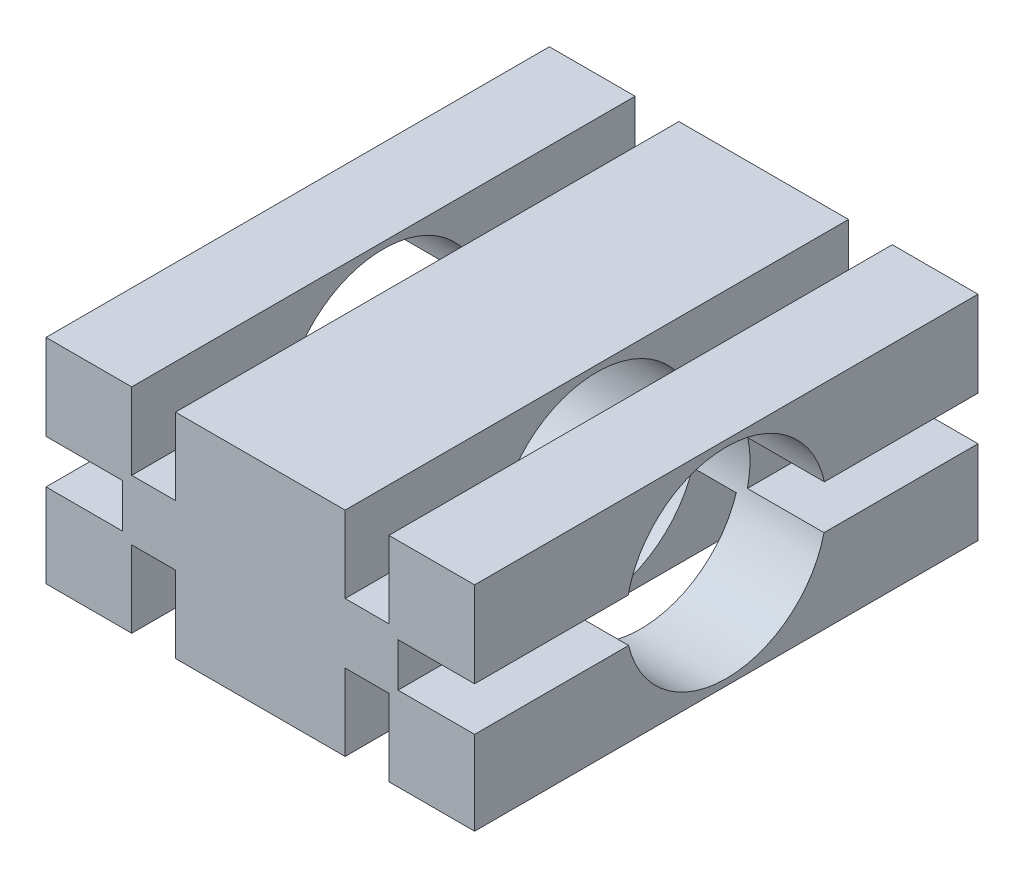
ISO-10303-21;
HEADER;
FILE_DESCRIPTION(('STEP AP214'),'2;1');
FILE_NAME('part.step','',(''),(''),'','','');
FILE_SCHEMA(('AUTOMOTIVE_DESIGN { 1 0 10303 214 1 1 1 1 }'));
ENDSEC;
DATA;
#1=APPLICATION_CONTEXT('core data for automotive mechanical design processes');
#2=APPLICATION_PROTOCOL_DEFINITION('international standard','automotive_design',2000,#1);
#3=PRODUCT_CONTEXT('',#1,'mechanical');
#4=PRODUCT('Part','Part','',(#3));
#5=PRODUCT_RELATED_PRODUCT_CATEGORY('part','',(#4));
#6=PRODUCT_DEFINITION_FORMATION('','',#4);
#7=PRODUCT_DEFINITION_CONTEXT('part definition',#1,'design');
#8=PRODUCT_DEFINITION('design','',#6,#7);
#9=PRODUCT_DEFINITION_SHAPE('','',#8);
#10=(LENGTH_UNIT() NAMED_UNIT(*) SI_UNIT(.MILLI.,.METRE.));
#11=(NAMED_UNIT(*) PLANE_ANGLE_UNIT() SI_UNIT($,.RADIAN.));
#12=(NAMED_UNIT(*) SI_UNIT($,.STERADIAN.) SOLID_ANGLE_UNIT());
#13=UNCERTAINTY_MEASURE_WITH_UNIT(LENGTH_MEASURE(1.E-05),#10,'distance_accuracy_value','');
#14=(GEOMETRIC_REPRESENTATION_CONTEXT(3) GLOBAL_UNCERTAINTY_ASSIGNED_CONTEXT((#13)) GLOBAL_UNIT_ASSIGNED_CONTEXT((#10,
#11,#12)) REPRESENTATION_CONTEXT('',''));
#15=CARTESIAN_POINT('',(0.,0.,0.));
#16=DIRECTION('',(0.,0.,1.));
#17=DIRECTION('',(1.,0.,0.));
#18=AXIS2_PLACEMENT_3D('',#15,#16,#17);
#19=CARTESIAN_POINT('',(11.938,10.668,70.104));
#20=DIRECTION('',(0.,1.,0.));
#21=DIRECTION('',(0.,0.,1.));
#22=AXIS2_PLACEMENT_3D('',#19,#20,#21);
#23=PLANE('',#22);
#24=DIRECTION('',(0.,0.,-1.));
#25=VECTOR('',#24,1.);
#26=CARTESIAN_POINT('',(18.034,10.668,70.104));
#27=LINE('',#26,#25);
#28=CARTESIAN_POINT('',(18.034,10.668,21.7254693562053));
#29=VERTEX_POINT('',#28);
#30=CARTESIAN_POINT('',(18.034,10.668,0.));
#31=VERTEX_POINT('',#30);
#32=EDGE_CURVE('E456',#29,#31,#27,.T.);
#33=ORIENTED_EDGE('',*,*,#32,.F.);
#34=DIRECTION('',(-1.,0.,0.));
#35=VECTOR('',#34,1.);
#36=CARTESIAN_POINT('',(59.69,10.668,21.7254693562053));
#37=LINE('',#36,#35);
#38=CARTESIAN_POINT('',(11.938,10.6680000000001,21.7254693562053));
#39=VERTEX_POINT('',#38);
#40=EDGE_CURVE('E55',#29,#39,#37,.T.);
#41=ORIENTED_EDGE('',*,*,#40,.T.);
#42=DIRECTION('',(0.,0.,-1.));
#43=VECTOR('',#42,1.);
#44=CARTESIAN_POINT('',(11.938,10.668,70.104));
#45=LINE('',#44,#43);
#46=CARTESIAN_POINT('',(11.938,10.668,0.));
#47=VERTEX_POINT('',#46);
#48=EDGE_CURVE('E461',#39,#47,#45,.T.);
#49=ORIENTED_EDGE('',*,*,#48,.T.);
#50=DIRECTION('',(1.,0.,0.));
#51=VECTOR('',#50,1.);
#52=CARTESIAN_POINT('',(11.938,10.668,0.));
#53=LINE('',#52,#51);
#54=EDGE_CURVE('E593',#47,#31,#53,.T.);
#55=ORIENTED_EDGE('',*,*,#54,.T.);
#56=EDGE_LOOP('',(#33,#41,#49,#55));
#57=FACE_BOUND('',#56,.T.);
#58=ADVANCED_FACE('F39',(#57),#23,.F.);
#59=CARTESIAN_POINT('',(47.752,10.668,70.104));
#60=DIRECTION('',(0.,1.,0.));
#61=DIRECTION('',(0.,0.,1.));
#62=AXIS2_PLACEMENT_3D('',#59,#60,#61);
#63=PLANE('',#62);
#64=DIRECTION('',(0.,0.,-1.));
#65=VECTOR('',#64,1.);
#66=CARTESIAN_POINT('',(47.752,10.668,70.104));
#67=LINE('',#66,#65);
#68=CARTESIAN_POINT('',(47.752,10.668,21.7254693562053));
#69=VERTEX_POINT('',#68);
#70=CARTESIAN_POINT('',(47.752,10.668,0.));
#71=VERTEX_POINT('',#70);
#72=EDGE_CURVE('E438',#69,#71,#67,.T.);
#73=ORIENTED_EDGE('',*,*,#72,.F.);
#74=DIRECTION('',(-1.,0.,0.));
#75=VECTOR('',#74,1.);
#76=CARTESIAN_POINT('',(59.69,10.668,21.7254693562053));
#77=LINE('',#76,#75);
#78=CARTESIAN_POINT('',(41.656,10.668,21.7254693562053));
#79=VERTEX_POINT('',#78);
#80=EDGE_CURVE('E63',#69,#79,#77,.T.);
#81=ORIENTED_EDGE('',*,*,#80,.T.);
#82=DIRECTION('',(0.,0.,-1.));
#83=VECTOR('',#82,1.);
#84=CARTESIAN_POINT('',(41.656,10.668,70.104));
#85=LINE('',#84,#83);
#86=CARTESIAN_POINT('',(41.656,10.668,0.));
#87=VERTEX_POINT('',#86);
#88=EDGE_CURVE('E443',#79,#87,#85,.T.);
#89=ORIENTED_EDGE('',*,*,#88,.T.);
#90=DIRECTION('',(1.,0.,0.));
#91=VECTOR('',#90,1.);
#92=CARTESIAN_POINT('',(47.752,10.668,0.));
#93=LINE('',#92,#91);
#94=EDGE_CURVE('E607',#87,#71,#93,.T.);
#95=ORIENTED_EDGE('',*,*,#94,.T.);
#96=EDGE_LOOP('',(#73,#81,#89,#95));
#97=FACE_BOUND('',#96,.T.);
#98=ADVANCED_FACE('F786',(#97),#63,.F.);
#99=CARTESIAN_POINT('',(59.69,11.684,70.104));
#100=DIRECTION('',(0.,-1.,0.));
#101=DIRECTION('',(0.,0.,-1.));
#102=AXIS2_PLACEMENT_3D('',#99,#100,#101);
#103=PLANE('',#102);
#104=DIRECTION('',(0.,0.,-1.));
#105=VECTOR('',#104,1.);
#106=CARTESIAN_POINT('',(59.69,11.684,70.104));
#107=LINE('',#106,#105);
#108=CARTESIAN_POINT('',(59.69,11.684,70.104));
#109=VERTEX_POINT('',#108);
#110=CARTESIAN_POINT('',(59.69,11.684,48.6564211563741));
#111=VERTEX_POINT('',#110);
#112=EDGE_CURVE('E426',#109,#111,#107,.T.);
#113=ORIENTED_EDGE('',*,*,#112,.T.);
#114=DIRECTION('',(-1.,0.,0.));
#115=VECTOR('',#114,1.);
#116=CARTESIAN_POINT('',(59.69,11.684,48.6564211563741));
#117=LINE('',#116,#115);
#118=CARTESIAN_POINT('',(49.022,11.684,48.6564211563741));
#119=VERTEX_POINT('',#118);
#120=EDGE_CURVE('E849',#111,#119,#117,.T.);
#121=ORIENTED_EDGE('',*,*,#120,.T.);
#122=DIRECTION('',(0.,0.,-1.));
#123=VECTOR('',#122,1.);
#124=CARTESIAN_POINT('',(49.022,11.684,70.104));
#125=LINE('',#124,#123);
#126=CARTESIAN_POINT('',(49.022,11.684,70.104));
#127=VERTEX_POINT('',#126);
#128=EDGE_CURVE('E421',#127,#119,#125,.T.);
#129=ORIENTED_EDGE('',*,*,#128,.F.);
#130=DIRECTION('',(-1.,0.,0.));
#131=VECTOR('',#130,1.);
#132=CARTESIAN_POINT('',(59.69,11.684,70.104));
#133=LINE('',#132,#131);
#134=EDGE_CURVE('E534',#109,#127,#133,.T.);
#135=ORIENTED_EDGE('',*,*,#134,.F.);
#136=EDGE_LOOP('',(#113,#121,#129,#135));
#137=FACE_BOUND('',#136,.T.);
#138=ADVANCED_FACE('F930',(#137),#103,.F.);
#139=CARTESIAN_POINT('',(49.022,17.78,70.104));
#140=DIRECTION('',(-1.,0.,0.));
#141=DIRECTION('',(0.,0.,1.));
#142=AXIS2_PLACEMENT_3D('',#139,#140,#141);
#143=PLANE('',#142);
#144=DIRECTION('',(0.,0.,-1.));
#145=VECTOR('',#144,1.);
#146=CARTESIAN_POINT('',(49.022,17.78,70.104));
#147=LINE('',#146,#145);
#148=CARTESIAN_POINT('',(49.022,17.78,21.3907899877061));
#149=VERTEX_POINT('',#148);
#150=CARTESIAN_POINT('',(49.022,17.78,0.));
#151=VERTEX_POINT('',#150);
#152=EDGE_CURVE('E415',#149,#151,#147,.T.);
#153=ORIENTED_EDGE('',*,*,#152,.F.);
#154=CARTESIAN_POINT('',(49.022,14.859,35.052));
#155=DIRECTION('',(-1.,0.,0.));
#156=DIRECTION('',(0.,0.,1.));
#157=AXIS2_PLACEMENT_3D('',#154,#155,#156);
#158=CIRCLE('',#157,13.97);
#159=CARTESIAN_POINT('',(49.022,11.684,21.4475788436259));
#160=VERTEX_POINT('',#159);
#161=EDGE_CURVE('E759',#149,#160,#158,.T.);
#162=ORIENTED_EDGE('',*,*,#161,.T.);
#163=CARTESIAN_POINT('',(49.022,11.684,0.));
#164=VERTEX_POINT('',#163);
#165=EDGE_CURVE('E420',#160,#164,#125,.T.);
#166=ORIENTED_EDGE('',*,*,#165,.T.);
#167=DIRECTION('',(0.,1.,0.));
#168=VECTOR('',#167,1.);
#169=CARTESIAN_POINT('',(49.022,17.78,0.));
#170=LINE('',#169,#168);
#171=EDGE_CURVE('E625',#164,#151,#170,.T.);
#172=ORIENTED_EDGE('',*,*,#171,.T.);
#173=EDGE_LOOP('',(#153,#162,#166,#172));
#174=FACE_BOUND('',#173,.T.);
#175=ADVANCED_FACE('F756',(#174),#143,.F.);
#176=CARTESIAN_POINT('',(59.69,17.78,70.104));
#177=DIRECTION('',(0.,1.,0.));
#178=DIRECTION('',(0.,0.,1.));
#179=AXIS2_PLACEMENT_3D('',#176,#177,#178);
#180=PLANE('',#179);
#181=DIRECTION('',(0.,0.,-1.));
#182=VECTOR('',#181,1.);
#183=CARTESIAN_POINT('',(59.69,17.78,70.104));
#184=LINE('',#183,#182);
#185=CARTESIAN_POINT('',(59.69,17.78,21.3907899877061));
#186=VERTEX_POINT('',#185);
#187=CARTESIAN_POINT('',(59.69,17.78,0.));
#188=VERTEX_POINT('',#187);
#189=EDGE_CURVE('E410',#186,#188,#184,.T.);
#190=ORIENTED_EDGE('',*,*,#189,.F.);
#191=DIRECTION('',(-1.,0.,0.));
#192=VECTOR('',#191,1.);
#193=CARTESIAN_POINT('',(59.69,17.78,21.3907899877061));
#194=LINE('',#193,#192);
#195=EDGE_CURVE('E846',#186,#149,#194,.T.);
#196=ORIENTED_EDGE('',*,*,#195,.T.);
#197=ORIENTED_EDGE('',*,*,#152,.T.);
#198=DIRECTION('',(1.,0.,0.));
#199=VECTOR('',#198,1.);
#200=CARTESIAN_POINT('',(59.69,17.78,0.));
#201=LINE('',#200,#199);
#202=EDGE_CURVE('E629',#151,#188,#201,.T.);
#203=ORIENTED_EDGE('',*,*,#202,.T.);
#204=EDGE_LOOP('',(#190,#196,#197,#203));
#205=FACE_BOUND('',#204,.T.);
#206=ADVANCED_FACE('F750',(#205),#180,.F.);
#207=CARTESIAN_POINT('',(47.752,19.05,70.104));
#208=DIRECTION('',(0.,-1.,0.));
#209=DIRECTION('',(0.,0.,-1.));
#210=AXIS2_PLACEMENT_3D('',#207,#208,#209);
#211=PLANE('',#210);
#212=DIRECTION('',(0.,0.,-1.));
#213=VECTOR('',#212,1.);
#214=CARTESIAN_POINT('',(47.752,19.05,70.104));
#215=LINE('',#214,#213);
#216=CARTESIAN_POINT('',(47.752,19.05,70.104));
#217=VERTEX_POINT('',#216);
#218=CARTESIAN_POINT('',(47.752,19.05,48.3785306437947));
#219=VERTEX_POINT('',#218);
#220=EDGE_CURVE('E398',#217,#219,#215,.T.);
#221=ORIENTED_EDGE('',*,*,#220,.T.);
#222=DIRECTION('',(-1.,0.,0.));
#223=VECTOR('',#222,1.);
#224=CARTESIAN_POINT('',(59.69,19.05,48.3785306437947));
#225=LINE('',#224,#223);
#226=CARTESIAN_POINT('',(41.656,19.05,48.3785306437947));
#227=VERTEX_POINT('',#226);
#228=EDGE_CURVE('E864',#219,#227,#225,.T.);
#229=ORIENTED_EDGE('',*,*,#228,.T.);
#230=DIRECTION('',(0.,0.,-1.));
#231=VECTOR('',#230,1.);
#232=CARTESIAN_POINT('',(41.656,19.05,70.104));
#233=LINE('',#232,#231);
#234=CARTESIAN_POINT('',(41.656,19.05,70.104));
#235=VERTEX_POINT('',#234);
#236=EDGE_CURVE('E393',#235,#227,#233,.T.);
#237=ORIENTED_EDGE('',*,*,#236,.F.);
#238=DIRECTION('',(-1.,0.,0.));
#239=VECTOR('',#238,1.);
#240=CARTESIAN_POINT('',(47.752,19.05,70.104));
#241=LINE('',#240,#239);
#242=EDGE_CURVE('E552',#217,#235,#241,.T.);
#243=ORIENTED_EDGE('',*,*,#242,.F.);
#244=EDGE_LOOP('',(#221,#229,#237,#243));
#245=FACE_BOUND('',#244,.T.);
#246=ADVANCED_FACE('F972',(#245),#211,.F.);
#247=CARTESIAN_POINT('',(11.938,19.05,70.104));
#248=DIRECTION('',(0.,-1.,0.));
#249=DIRECTION('',(0.,0.,-1.));
#250=AXIS2_PLACEMENT_3D('',#247,#248,#249);
#251=PLANE('',#250);
#252=DIRECTION('',(0.,0.,-1.));
#253=VECTOR('',#252,1.);
#254=CARTESIAN_POINT('',(18.034,19.05,70.104));
#255=LINE('',#254,#253);
#256=CARTESIAN_POINT('',(18.034,19.05,70.104));
#257=VERTEX_POINT('',#256);
#258=CARTESIAN_POINT('',(18.034,19.05,48.3785306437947));
#259=VERTEX_POINT('',#258);
#260=EDGE_CURVE('E380',#257,#259,#255,.T.);
#261=ORIENTED_EDGE('',*,*,#260,.T.);
#262=DIRECTION('',(-1.,0.,0.));
#263=VECTOR('',#262,1.);
#264=CARTESIAN_POINT('',(59.69,19.05,48.3785306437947));
#265=LINE('',#264,#263);
#266=CARTESIAN_POINT('',(11.938,19.05,48.3785306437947));
#267=VERTEX_POINT('',#266);
#268=EDGE_CURVE('E875',#259,#267,#265,.T.);
#269=ORIENTED_EDGE('',*,*,#268,.T.);
#270=DIRECTION('',(0.,0.,-1.));
#271=VECTOR('',#270,1.);
#272=CARTESIAN_POINT('',(11.938,19.05,70.104));
#273=LINE('',#272,#271);
#274=CARTESIAN_POINT('',(11.938,19.05,70.104));
#275=VERTEX_POINT('',#274);
#276=EDGE_CURVE('E375',#275,#267,#273,.T.);
#277=ORIENTED_EDGE('',*,*,#276,.F.);
#278=DIRECTION('',(-1.,0.,0.));
#279=VECTOR('',#278,1.);
#280=CARTESIAN_POINT('',(11.938,19.05,70.104));
#281=LINE('',#280,#279);
#282=EDGE_CURVE('E564',#257,#275,#281,.T.);
#283=ORIENTED_EDGE('',*,*,#282,.F.);
#284=EDGE_LOOP('',(#261,#269,#277,#283));
#285=FACE_BOUND('',#284,.T.);
#286=ADVANCED_FACE('F907',(#285),#251,.F.);
#287=CARTESIAN_POINT('',(0.,17.78,70.104));
#288=DIRECTION('',(0.,1.,0.));
#289=DIRECTION('',(0.,0.,1.));
#290=AXIS2_PLACEMENT_3D('',#287,#288,#289);
#291=PLANE('',#290);
#292=DIRECTION('',(0.,0.,-1.));
#293=VECTOR('',#292,1.);
#294=CARTESIAN_POINT('',(10.668,17.78,70.104));
#295=LINE('',#294,#293);
#296=CARTESIAN_POINT('',(10.668,17.78,21.390789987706));
#297=VERTEX_POINT('',#296);
#298=CARTESIAN_POINT('',(10.668,17.78,0.));
#299=VERTEX_POINT('',#298);
#300=EDGE_CURVE('E356',#297,#299,#295,.T.);
#301=ORIENTED_EDGE('',*,*,#300,.F.);
#302=DIRECTION('',(-1.,0.,0.));
#303=VECTOR('',#302,1.);
#304=CARTESIAN_POINT('',(59.69,17.78,21.3907899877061));
#305=LINE('',#304,#303);
#306=CARTESIAN_POINT('',(0.,17.78,21.390789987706));
#307=VERTEX_POINT('',#306);
#308=EDGE_CURVE('E889',#297,#307,#305,.T.);
#309=ORIENTED_EDGE('',*,*,#308,.T.);
#310=DIRECTION('',(0.,0.,-1.));
#311=VECTOR('',#310,1.);
#312=CARTESIAN_POINT('',(0.,17.78,70.104));
#313=LINE('',#312,#311);
#314=CARTESIAN_POINT('',(0.,17.78,0.));
#315=VERTEX_POINT('',#314);
#316=EDGE_CURVE('E361',#307,#315,#313,.T.);
#317=ORIENTED_EDGE('',*,*,#316,.T.);
#318=DIRECTION('',(1.,0.,0.));
#319=VECTOR('',#318,1.);
#320=CARTESIAN_POINT('',(0.,17.78,0.));
#321=LINE('',#320,#319);
#322=EDGE_CURVE('E491',#315,#299,#321,.T.);
#323=ORIENTED_EDGE('',*,*,#322,.T.);
#324=EDGE_LOOP('',(#301,#309,#317,#323));
#325=FACE_BOUND('',#324,.T.);
#326=ADVANCED_FACE('F673',(#325),#291,.F.);
#327=CARTESIAN_POINT('',(10.668,17.78,70.104));
#328=DIRECTION('',(1.,0.,0.));
#329=DIRECTION('',(0.,0.,-1.));
#330=AXIS2_PLACEMENT_3D('',#327,#328,#329);
#331=PLANE('',#330);
#332=CARTESIAN_POINT('',(10.668,17.78,70.104));
#333=VERTEX_POINT('',#332);
#334=CARTESIAN_POINT('',(10.668,17.78,48.7132100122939));
#335=VERTEX_POINT('',#334);
#336=EDGE_CURVE('E357',#333,#335,#295,.T.);
#337=ORIENTED_EDGE('',*,*,#336,.T.);
#338=CARTESIAN_POINT('',(10.668,14.8590000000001,35.052));
#339=DIRECTION('',(1.,0.,0.));
#340=DIRECTION('',(0.,0.,-1.));
#341=AXIS2_PLACEMENT_3D('',#338,#339,#340);
#342=CIRCLE('',#341,13.97);
#343=CARTESIAN_POINT('',(10.668,11.6840000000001,48.6564211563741));
#344=VERTEX_POINT('',#343);
#345=EDGE_CURVE('E888',#335,#344,#342,.T.);
#346=ORIENTED_EDGE('',*,*,#345,.T.);
#347=DIRECTION('',(0.,0.,-1.));
#348=VECTOR('',#347,1.);
#349=CARTESIAN_POINT('',(10.668,11.684,70.104));
#350=LINE('',#349,#348);
#351=CARTESIAN_POINT('',(10.668,11.684,70.104));
#352=VERTEX_POINT('',#351);
#353=EDGE_CURVE('E339',#352,#344,#350,.T.);
#354=ORIENTED_EDGE('',*,*,#353,.F.);
#355=DIRECTION('',(0.,-1.,0.));
#356=VECTOR('',#355,1.);
#357=CARTESIAN_POINT('',(10.668,17.78,70.104));
#358=LINE('',#357,#356);
#359=EDGE_CURVE('E579',#333,#352,#358,.T.);
#360=ORIENTED_EDGE('',*,*,#359,.F.);
#361=EDGE_LOOP('',(#337,#346,#354,#360));
#362=FACE_BOUND('',#361,.T.);
#363=ADVANCED_FACE('F915',(#362),#331,.F.);
#364=CARTESIAN_POINT('',(0.,11.684,70.104));
#365=DIRECTION('',(0.,-1.,0.));
#366=DIRECTION('',(0.,0.,-1.));
#367=AXIS2_PLACEMENT_3D('',#364,#365,#366);
#368=PLANE('',#367);
#369=ORIENTED_EDGE('',*,*,#353,.T.);
#370=DIRECTION('',(-1.,0.,0.));
#371=VECTOR('',#370,1.);
#372=CARTESIAN_POINT('',(59.69,11.684,48.6564211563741));
#373=LINE('',#372,#371);
#374=CARTESIAN_POINT('',(0.,11.684,48.6564211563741));
#375=VERTEX_POINT('',#374);
#376=EDGE_CURVE('E11',#344,#375,#373,.T.);
#377=ORIENTED_EDGE('',*,*,#376,.T.);
#378=DIRECTION('',(0.,0.,-1.));
#379=VECTOR('',#378,1.);
#380=CARTESIAN_POINT('',(0.,11.684,70.104));
#381=LINE('',#380,#379);
#382=CARTESIAN_POINT('',(0.,11.684,70.104));
#383=VERTEX_POINT('',#382);
#384=EDGE_CURVE('E336',#383,#375,#381,.T.);
#385=ORIENTED_EDGE('',*,*,#384,.F.);
#386=DIRECTION('',(-1.,0.,0.));
#387=VECTOR('',#386,1.);
#388=CARTESIAN_POINT('',(0.,11.684,70.104));
#389=LINE('',#388,#387);
#390=EDGE_CURVE('E350',#352,#383,#389,.T.);
#391=ORIENTED_EDGE('',*,*,#390,.F.);
#392=EDGE_LOOP('',(#369,#377,#385,#391));
#393=FACE_BOUND('',#392,.T.);
#394=ADVANCED_FACE('F334',(#393),#368,.F.);
#395=CARTESIAN_POINT('',(0.,0.,70.104));
#396=DIRECTION('',(1.,0.,0.));
#397=DIRECTION('',(0.,1.,0.));
#398=AXIS2_PLACEMENT_3D('',#395,#396,#397);
#399=PLANE('',#398);
#400=ORIENTED_EDGE('',*,*,#384,.T.);
#401=CARTESIAN_POINT('',(0.,14.8590000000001,35.052));
#402=DIRECTION('',(-1.,0.,0.));
#403=DIRECTION('',(0.,-1.,0.));
#404=AXIS2_PLACEMENT_3D('',#401,#402,#403);
#405=CIRCLE('',#404,13.97);
#406=CARTESIAN_POINT('',(0.,11.684,21.4475788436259));
#407=VERTEX_POINT('',#406);
#408=EDGE_CURVE('E320',#407,#375,#405,.T.);
#409=ORIENTED_EDGE('',*,*,#408,.F.);
#410=CARTESIAN_POINT('',(0.,11.684,0.));
#411=VERTEX_POINT('',#410);
#412=EDGE_CURVE('E345',#407,#411,#381,.T.);
#413=ORIENTED_EDGE('',*,*,#412,.T.);
#414=DIRECTION('',(0.,-1.,0.));
#415=VECTOR('',#414,1.);
#416=CARTESIAN_POINT('',(0.,0.,0.));
#417=LINE('',#416,#415);
#418=CARTESIAN_POINT('',(0.,0.,0.));
#419=VERTEX_POINT('',#418);
#420=EDGE_CURVE('E495',#411,#419,#417,.T.);
#421=ORIENTED_EDGE('',*,*,#420,.T.);
#422=DIRECTION('',(0.,0.,-1.));
#423=VECTOR('',#422,1.);
#424=CARTESIAN_POINT('',(0.,0.,70.104));
#425=LINE('',#424,#423);
#426=CARTESIAN_POINT('',(0.,0.,70.104));
#427=VERTEX_POINT('',#426);
#428=EDGE_CURVE('E470',#427,#419,#425,.T.);
#429=ORIENTED_EDGE('',*,*,#428,.F.);
#430=DIRECTION('',(0.,-1.,0.));
#431=VECTOR('',#430,1.);
#432=CARTESIAN_POINT('',(0.,0.,70.104));
#433=LINE('',#432,#431);
#434=EDGE_CURVE('E342',#383,#427,#433,.T.);
#435=ORIENTED_EDGE('',*,*,#434,.F.);
#436=EDGE_LOOP('',(#400,#409,#413,#421,#429,#435));
#437=FACE_BOUND('',#436,.T.);
#438=ADVANCED_FACE('F41',(#437),#399,.F.);
#439=CARTESIAN_POINT('',(0.,0.,70.104));
#440=DIRECTION('',(0.,1.,0.));
#441=DIRECTION('',(0.,0.,1.));
#442=AXIS2_PLACEMENT_3D('',#439,#440,#441);
#443=PLANE('',#442);
#444=DIRECTION('',(1.,0.,0.));
#445=VECTOR('',#444,1.);
#446=CARTESIAN_POINT('',(0.,0.,0.));
#447=LINE('',#446,#445);
#448=CARTESIAN_POINT('',(11.938,0.,0.));
#449=VERTEX_POINT('',#448);
#450=EDGE_CURVE('E586',#419,#449,#447,.T.);
#451=ORIENTED_EDGE('',*,*,#450,.T.);
#452=DIRECTION('',(0.,0.,-1.));
#453=VECTOR('',#452,1.);
#454=CARTESIAN_POINT('',(11.938,0.,70.104));
#455=LINE('',#454,#453);
#456=CARTESIAN_POINT('',(11.938,0.,70.104));
#457=VERTEX_POINT('',#456);
#458=EDGE_CURVE('E466',#457,#449,#455,.T.);
#459=ORIENTED_EDGE('',*,*,#458,.F.);
#460=DIRECTION('',(1.,0.,0.));
#461=VECTOR('',#460,1.);
#462=CARTESIAN_POINT('',(0.,0.,70.104));
#463=LINE('',#462,#461);
#464=EDGE_CURVE('E498',#427,#457,#463,.T.);
#465=ORIENTED_EDGE('',*,*,#464,.F.);
#466=ORIENTED_EDGE('',*,*,#428,.T.);
#467=EDGE_LOOP('',(#451,#459,#465,#466));
#468=FACE_BOUND('',#467,.T.);
#469=ADVANCED_FACE('F817',(#468),#443,.F.);
#470=CARTESIAN_POINT('',(11.938,0.,70.104));
#471=DIRECTION('',(-1.,0.,0.));
#472=DIRECTION('',(0.,0.,1.));
#473=AXIS2_PLACEMENT_3D('',#470,#471,#472);
#474=PLANE('',#473);
#475=ORIENTED_EDGE('',*,*,#48,.F.);
#476=CARTESIAN_POINT('',(11.938,14.8590000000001,35.052));
#477=DIRECTION('',(-1.,0.,0.));
#478=DIRECTION('',(0.,0.,1.));
#479=AXIS2_PLACEMENT_3D('',#476,#477,#478);
#480=CIRCLE('',#479,13.97);
#481=CARTESIAN_POINT('',(11.938,10.6680000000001,48.3785306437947));
#482=VERTEX_POINT('',#481);
#483=EDGE_CURVE('E505',#39,#482,#480,.T.);
#484=ORIENTED_EDGE('',*,*,#483,.T.);
#485=CARTESIAN_POINT('',(11.938,10.668,70.104));
#486=VERTEX_POINT('',#485);
#487=EDGE_CURVE('E462',#486,#482,#45,.T.);
#488=ORIENTED_EDGE('',*,*,#487,.F.);
#489=DIRECTION('',(0.,1.,0.));
#490=VECTOR('',#489,1.);
#491=CARTESIAN_POINT('',(11.938,0.,70.104));
#492=LINE('',#491,#490);
#493=EDGE_CURVE('E502',#457,#486,#492,.T.);
#494=ORIENTED_EDGE('',*,*,#493,.F.);
#495=ORIENTED_EDGE('',*,*,#458,.T.);
#496=DIRECTION('',(0.,1.,0.));
#497=VECTOR('',#496,1.);
#498=CARTESIAN_POINT('',(11.938,0.,0.));
#499=LINE('',#498,#497);
#500=EDGE_CURVE('E589',#449,#47,#499,.T.);
#501=ORIENTED_EDGE('',*,*,#500,.T.);
#502=EDGE_LOOP('',(#475,#484,#488,#494,#495,#501));
#503=FACE_BOUND('',#502,.T.);
#504=ADVANCED_FACE('F812',(#503),#474,.F.);
#505=ORIENTED_EDGE('',*,*,#487,.T.);
#506=DIRECTION('',(-1.,0.,0.));
#507=VECTOR('',#506,1.);
#508=CARTESIAN_POINT('',(59.69,10.668,48.3785306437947));
#509=LINE('',#508,#507);
#510=CARTESIAN_POINT('',(18.034,10.668,48.3785306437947));
#511=VERTEX_POINT('',#510);
#512=EDGE_CURVE('E824',#482,#511,#509,.F.);
#513=ORIENTED_EDGE('',*,*,#512,.T.);
#514=CARTESIAN_POINT('',(18.034,10.668,70.104));
#515=VERTEX_POINT('',#514);
#516=EDGE_CURVE('E457',#515,#511,#27,.T.);
#517=ORIENTED_EDGE('',*,*,#516,.F.);
#518=DIRECTION('',(1.,0.,0.));
#519=VECTOR('',#518,1.);
#520=CARTESIAN_POINT('',(11.938,10.668,70.104));
#521=LINE('',#520,#519);
#522=EDGE_CURVE('E510',#486,#515,#521,.T.);
#523=ORIENTED_EDGE('',*,*,#522,.F.);
#524=EDGE_LOOP('',(#505,#513,#517,#523));
#525=FACE_BOUND('',#524,.T.);
#526=ADVANCED_FACE('F823',(#525),#23,.F.);
#527=CARTESIAN_POINT('',(18.034,0.,70.104));
#528=DIRECTION('',(1.,0.,0.));
#529=DIRECTION('',(0.,0.,-1.));
#530=AXIS2_PLACEMENT_3D('',#527,#528,#529);
#531=PLANE('',#530);
#532=ORIENTED_EDGE('',*,*,#516,.T.);
#533=CARTESIAN_POINT('',(18.034,14.859,35.052));
#534=DIRECTION('',(1.,0.,0.));
#535=DIRECTION('',(0.,0.,-1.));
#536=AXIS2_PLACEMENT_3D('',#533,#534,#535);
#537=CIRCLE('',#536,13.97);
#538=EDGE_CURVE('E825',#511,#29,#537,.T.);
#539=ORIENTED_EDGE('',*,*,#538,.T.);
#540=ORIENTED_EDGE('',*,*,#32,.T.);
#541=DIRECTION('',(0.,-1.,0.));
#542=VECTOR('',#541,1.);
#543=CARTESIAN_POINT('',(18.034,0.,0.));
#544=LINE('',#543,#542);
#545=CARTESIAN_POINT('',(18.034,0.,0.));
#546=VERTEX_POINT('',#545);
#547=EDGE_CURVE('E597',#31,#546,#544,.T.);
#548=ORIENTED_EDGE('',*,*,#547,.T.);
#549=DIRECTION('',(0.,0.,-1.));
#550=VECTOR('',#549,1.);
#551=CARTESIAN_POINT('',(18.034,0.,70.104));
#552=LINE('',#551,#550);
#553=CARTESIAN_POINT('',(18.034,0.,70.104));
#554=VERTEX_POINT('',#553);
#555=EDGE_CURVE('E452',#554,#546,#552,.T.);
#556=ORIENTED_EDGE('',*,*,#555,.F.);
#557=DIRECTION('',(0.,-1.,0.));
#558=VECTOR('',#557,1.);
#559=CARTESIAN_POINT('',(18.034,0.,70.104));
#560=LINE('',#559,#558);
#561=EDGE_CURVE('E513',#515,#554,#560,.T.);
#562=ORIENTED_EDGE('',*,*,#561,.F.);
#563=EDGE_LOOP('',(#532,#539,#540,#548,#556,#562));
#564=FACE_BOUND('',#563,.T.);
#565=ADVANCED_FACE('F803',(#564),#531,.F.);
#566=CARTESIAN_POINT('',(18.034,0.,70.104));
#567=DIRECTION('',(0.,1.,0.));
#568=DIRECTION('',(0.,0.,1.));
#569=AXIS2_PLACEMENT_3D('',#566,#567,#568);
#570=PLANE('',#569);
#571=DIRECTION('',(1.,0.,0.));
#572=VECTOR('',#571,1.);
#573=CARTESIAN_POINT('',(18.034,0.,0.));
#574=LINE('',#573,#572);
#575=CARTESIAN_POINT('',(41.656,0.,0.));
#576=VERTEX_POINT('',#575);
#577=EDGE_CURVE('E600',#546,#576,#574,.T.);
#578=ORIENTED_EDGE('',*,*,#577,.T.);
#579=DIRECTION('',(0.,0.,-1.));
#580=VECTOR('',#579,1.);
#581=CARTESIAN_POINT('',(41.656,0.,70.104));
#582=LINE('',#581,#580);
#583=CARTESIAN_POINT('',(41.656,0.,70.104));
#584=VERTEX_POINT('',#583);
#585=EDGE_CURVE('E448',#584,#576,#582,.T.);
#586=ORIENTED_EDGE('',*,*,#585,.F.);
#587=DIRECTION('',(1.,0.,0.));
#588=VECTOR('',#587,1.);
#589=CARTESIAN_POINT('',(18.034,0.,70.104));
#590=LINE('',#589,#588);
#591=EDGE_CURVE('E516',#554,#584,#590,.T.);
#592=ORIENTED_EDGE('',*,*,#591,.F.);
#593=ORIENTED_EDGE('',*,*,#555,.T.);
#594=EDGE_LOOP('',(#578,#586,#592,#593));
#595=FACE_BOUND('',#594,.T.);
#596=ADVANCED_FACE('F799',(#595),#570,.F.);
#597=CARTESIAN_POINT('',(41.656,0.,70.104));
#598=DIRECTION('',(-1.,0.,0.));
#599=DIRECTION('',(0.,0.,1.));
#600=AXIS2_PLACEMENT_3D('',#597,#598,#599);
#601=PLANE('',#600);
#602=ORIENTED_EDGE('',*,*,#88,.F.);
#603=CARTESIAN_POINT('',(41.656,14.859,35.052));
#604=DIRECTION('',(-1.,0.,0.));
#605=DIRECTION('',(0.,0.,1.));
#606=AXIS2_PLACEMENT_3D('',#603,#604,#605);
#607=CIRCLE('',#606,13.97);
#608=CARTESIAN_POINT('',(41.656,10.668,48.3785306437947));
#609=VERTEX_POINT('',#608);
#610=EDGE_CURVE('E827',#79,#609,#607,.T.);
#611=ORIENTED_EDGE('',*,*,#610,.T.);
#612=CARTESIAN_POINT('',(41.656,10.668,70.104));
#613=VERTEX_POINT('',#612);
#614=EDGE_CURVE('E444',#613,#609,#85,.T.);
#615=ORIENTED_EDGE('',*,*,#614,.F.);
#616=DIRECTION('',(0.,1.,0.));
#617=VECTOR('',#616,1.);
#618=CARTESIAN_POINT('',(41.656,0.,70.104));
#619=LINE('',#618,#617);
#620=EDGE_CURVE('E519',#584,#613,#619,.T.);
#621=ORIENTED_EDGE('',*,*,#620,.F.);
#622=ORIENTED_EDGE('',*,*,#585,.T.);
#623=DIRECTION('',(0.,1.,0.));
#624=VECTOR('',#623,1.);
#625=CARTESIAN_POINT('',(41.656,0.,0.));
#626=LINE('',#625,#624);
#627=EDGE_CURVE('E603',#576,#87,#626,.T.);
#628=ORIENTED_EDGE('',*,*,#627,.T.);
#629=EDGE_LOOP('',(#602,#611,#615,#621,#622,#628));
#630=FACE_BOUND('',#629,.T.);
#631=ADVANCED_FACE('F792',(#630),#601,.F.);
#632=ORIENTED_EDGE('',*,*,#614,.T.);
#633=DIRECTION('',(-1.,0.,0.));
#634=VECTOR('',#633,1.);
#635=CARTESIAN_POINT('',(59.69,10.668,48.3785306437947));
#636=LINE('',#635,#634);
#637=CARTESIAN_POINT('',(47.752,10.668,48.3785306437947));
#638=VERTEX_POINT('',#637);
#639=EDGE_CURVE('E838',#609,#638,#636,.F.);
#640=ORIENTED_EDGE('',*,*,#639,.T.);
#641=CARTESIAN_POINT('',(47.752,10.668,70.104));
#642=VERTEX_POINT('',#641);
#643=EDGE_CURVE('E439',#642,#638,#67,.T.);
#644=ORIENTED_EDGE('',*,*,#643,.F.);
#645=DIRECTION('',(1.,0.,0.));
#646=VECTOR('',#645,1.);
#647=CARTESIAN_POINT('',(47.752,10.668,70.104));
#648=LINE('',#647,#646);
#649=EDGE_CURVE('E522',#613,#642,#648,.T.);
#650=ORIENTED_EDGE('',*,*,#649,.F.);
#651=EDGE_LOOP('',(#632,#640,#644,#650));
#652=FACE_BOUND('',#651,.T.);
#653=ADVANCED_FACE('F932',(#652),#63,.F.);
#654=CARTESIAN_POINT('',(47.752,0.,70.104));
#655=DIRECTION('',(1.,0.,0.));
#656=DIRECTION('',(0.,0.,-1.));
#657=AXIS2_PLACEMENT_3D('',#654,#655,#656);
#658=PLANE('',#657);
#659=ORIENTED_EDGE('',*,*,#643,.T.);
#660=CARTESIAN_POINT('',(47.752,14.859,35.052));
#661=DIRECTION('',(1.,0.,0.));
#662=DIRECTION('',(0.,0.,-1.));
#663=AXIS2_PLACEMENT_3D('',#660,#661,#662);
#664=CIRCLE('',#663,13.97);
#665=EDGE_CURVE('E783',#638,#69,#664,.T.);
#666=ORIENTED_EDGE('',*,*,#665,.T.);
#667=ORIENTED_EDGE('',*,*,#72,.T.);
#668=DIRECTION('',(0.,-1.,0.));
#669=VECTOR('',#668,1.);
#670=CARTESIAN_POINT('',(47.752,0.,0.));
#671=LINE('',#670,#669);
#672=CARTESIAN_POINT('',(47.752,0.,0.));
#673=VERTEX_POINT('',#672);
#674=EDGE_CURVE('E611',#71,#673,#671,.T.);
#675=ORIENTED_EDGE('',*,*,#674,.T.);
#676=DIRECTION('',(0.,0.,-1.));
#677=VECTOR('',#676,1.);
#678=CARTESIAN_POINT('',(47.752,0.,70.104));
#679=LINE('',#678,#677);
#680=CARTESIAN_POINT('',(47.752,0.,70.104));
#681=VERTEX_POINT('',#680);
#682=EDGE_CURVE('E434',#681,#673,#679,.T.);
#683=ORIENTED_EDGE('',*,*,#682,.F.);
#684=DIRECTION('',(0.,-1.,0.));
#685=VECTOR('',#684,1.);
#686=CARTESIAN_POINT('',(47.752,0.,70.104));
#687=LINE('',#686,#685);
#688=EDGE_CURVE('E525',#642,#681,#687,.T.);
#689=ORIENTED_EDGE('',*,*,#688,.F.);
#690=EDGE_LOOP('',(#659,#666,#667,#675,#683,#689));
#691=FACE_BOUND('',#690,.T.);
#692=ADVANCED_FACE('F781',(#691),#658,.F.);
#693=CARTESIAN_POINT('',(47.752,0.,70.104));
#694=DIRECTION('',(0.,1.,0.));
#695=DIRECTION('',(0.,0.,1.));
#696=AXIS2_PLACEMENT_3D('',#693,#694,#695);
#697=PLANE('',#696);
#698=DIRECTION('',(1.,0.,0.));
#699=VECTOR('',#698,1.);
#700=CARTESIAN_POINT('',(47.752,0.,0.));
#701=LINE('',#700,#699);
#702=CARTESIAN_POINT('',(59.69,0.,0.));
#703=VERTEX_POINT('',#702);
#704=EDGE_CURVE('E614',#673,#703,#701,.T.);
#705=ORIENTED_EDGE('',*,*,#704,.T.);
#706=DIRECTION('',(0.,0.,-1.));
#707=VECTOR('',#706,1.);
#708=CARTESIAN_POINT('',(59.69,0.,70.104));
#709=LINE('',#708,#707);
#710=CARTESIAN_POINT('',(59.69,0.,70.104));
#711=VERTEX_POINT('',#710);
#712=EDGE_CURVE('E430',#711,#703,#709,.T.);
#713=ORIENTED_EDGE('',*,*,#712,.F.);
#714=DIRECTION('',(1.,0.,0.));
#715=VECTOR('',#714,1.);
#716=CARTESIAN_POINT('',(47.752,0.,70.104));
#717=LINE('',#716,#715);
#718=EDGE_CURVE('E528',#681,#711,#717,.T.);
#719=ORIENTED_EDGE('',*,*,#718,.F.);
#720=ORIENTED_EDGE('',*,*,#682,.T.);
#721=EDGE_LOOP('',(#705,#713,#719,#720));
#722=FACE_BOUND('',#721,.T.);
#723=ADVANCED_FACE('F776',(#722),#697,.F.);
#724=CARTESIAN_POINT('',(59.69,0.,70.104));
#725=DIRECTION('',(-1.,0.,0.));
#726=DIRECTION('',(0.,0.,1.));
#727=AXIS2_PLACEMENT_3D('',#724,#725,#726);
#728=PLANE('',#727);
#729=CARTESIAN_POINT('',(59.69,11.684,21.4475788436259));
#730=VERTEX_POINT('',#729);
#731=CARTESIAN_POINT('',(59.69,11.684,0.));
#732=VERTEX_POINT('',#731);
#733=EDGE_CURVE('E425',#730,#732,#107,.T.);
#734=ORIENTED_EDGE('',*,*,#733,.F.);
#735=CARTESIAN_POINT('',(59.69,14.859,35.052));
#736=DIRECTION('',(-1.,0.,0.));
#737=DIRECTION('',(0.,-1.,0.));
#738=AXIS2_PLACEMENT_3D('',#735,#736,#737);
#739=CIRCLE('',#738,13.97);
#740=EDGE_CURVE('E894',#730,#111,#739,.T.);
#741=ORIENTED_EDGE('',*,*,#740,.T.);
#742=ORIENTED_EDGE('',*,*,#112,.F.);
#743=DIRECTION('',(0.,1.,0.));
#744=VECTOR('',#743,1.);
#745=CARTESIAN_POINT('',(59.69,0.,70.104));
#746=LINE('',#745,#744);
#747=EDGE_CURVE('E531',#711,#109,#746,.T.);
#748=ORIENTED_EDGE('',*,*,#747,.F.);
#749=ORIENTED_EDGE('',*,*,#712,.T.);
#750=DIRECTION('',(0.,1.,0.));
#751=VECTOR('',#750,1.);
#752=CARTESIAN_POINT('',(59.69,0.,0.));
#753=LINE('',#752,#751);
#754=EDGE_CURVE('E617',#703,#732,#753,.T.);
#755=ORIENTED_EDGE('',*,*,#754,.T.);
#756=EDGE_LOOP('',(#734,#741,#742,#748,#749,#755));
#757=FACE_BOUND('',#756,.T.);
#758=ADVANCED_FACE('F769',(#757),#728,.F.);
#759=ORIENTED_EDGE('',*,*,#165,.F.);
#760=DIRECTION('',(-1.,0.,0.));
#761=VECTOR('',#760,1.);
#762=CARTESIAN_POINT('',(59.69,11.684,21.4475788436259));
#763=LINE('',#762,#761);
#764=EDGE_CURVE('E765',#160,#730,#763,.F.);
#765=ORIENTED_EDGE('',*,*,#764,.T.);
#766=ORIENTED_EDGE('',*,*,#733,.T.);
#767=DIRECTION('',(-1.,0.,0.));
#768=VECTOR('',#767,1.);
#769=CARTESIAN_POINT('',(59.69,11.684,0.));
#770=LINE('',#769,#768);
#771=EDGE_CURVE('E621',#732,#164,#770,.T.);
#772=ORIENTED_EDGE('',*,*,#771,.T.);
#773=EDGE_LOOP('',(#759,#765,#766,#772));
#774=FACE_BOUND('',#773,.T.);
#775=ADVANCED_FACE('F763',(#774),#103,.F.);
#776=ORIENTED_EDGE('',*,*,#128,.T.);
#777=CARTESIAN_POINT('',(49.022,17.78,48.7132100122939));
#778=VERTEX_POINT('',#777);
#779=EDGE_CURVE('E853',#119,#778,#158,.T.);
#780=ORIENTED_EDGE('',*,*,#779,.T.);
#781=CARTESIAN_POINT('',(49.022,17.78,70.104));
#782=VERTEX_POINT('',#781);
#783=EDGE_CURVE('E416',#782,#778,#147,.T.);
#784=ORIENTED_EDGE('',*,*,#783,.F.);
#785=DIRECTION('',(0.,1.,0.));
#786=VECTOR('',#785,1.);
#787=CARTESIAN_POINT('',(49.022,17.78,70.104));
#788=LINE('',#787,#786);
#789=EDGE_CURVE('E537',#127,#782,#788,.T.);
#790=ORIENTED_EDGE('',*,*,#789,.F.);
#791=EDGE_LOOP('',(#776,#780,#784,#790));
#792=FACE_BOUND('',#791,.T.);
#793=ADVANCED_FACE('F1000',(#792),#143,.F.);
#794=ORIENTED_EDGE('',*,*,#783,.T.);
#795=DIRECTION('',(-1.,0.,0.));
#796=VECTOR('',#795,1.);
#797=CARTESIAN_POINT('',(59.69,17.78,48.7132100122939));
#798=LINE('',#797,#796);
#799=CARTESIAN_POINT('',(59.69,17.78,48.7132100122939));
#800=VERTEX_POINT('',#799);
#801=EDGE_CURVE('E857',#778,#800,#798,.F.);
#802=ORIENTED_EDGE('',*,*,#801,.T.);
#803=CARTESIAN_POINT('',(59.69,17.78,70.104));
#804=VERTEX_POINT('',#803);
#805=EDGE_CURVE('E411',#804,#800,#184,.T.);
#806=ORIENTED_EDGE('',*,*,#805,.F.);
#807=DIRECTION('',(1.,0.,0.));
#808=VECTOR('',#807,1.);
#809=CARTESIAN_POINT('',(59.69,17.78,70.104));
#810=LINE('',#809,#808);
#811=EDGE_CURVE('E540',#782,#804,#810,.T.);
#812=ORIENTED_EDGE('',*,*,#811,.F.);
#813=EDGE_LOOP('',(#794,#802,#806,#812));
#814=FACE_BOUND('',#813,.T.);
#815=ADVANCED_FACE('F991',(#814),#180,.F.);
#816=CARTESIAN_POINT('',(59.69,17.78,70.104));
#817=DIRECTION('',(-1.,0.,0.));
#818=DIRECTION('',(0.,0.,1.));
#819=AXIS2_PLACEMENT_3D('',#816,#817,#818);
#820=PLANE('',#819);
#821=ORIENTED_EDGE('',*,*,#805,.T.);
#822=EDGE_CURVE('E746',#800,#186,#739,.T.);
#823=ORIENTED_EDGE('',*,*,#822,.T.);
#824=ORIENTED_EDGE('',*,*,#189,.T.);
#825=DIRECTION('',(0.,1.,0.));
#826=VECTOR('',#825,1.);
#827=CARTESIAN_POINT('',(59.69,17.78,0.));
#828=LINE('',#827,#826);
#829=CARTESIAN_POINT('',(59.69,29.718,0.));
#830=VERTEX_POINT('',#829);
#831=EDGE_CURVE('E633',#188,#830,#828,.T.);
#832=ORIENTED_EDGE('',*,*,#831,.T.);
#833=DIRECTION('',(0.,0.,-1.));
#834=VECTOR('',#833,1.);
#835=CARTESIAN_POINT('',(59.69,29.718,70.104));
#836=LINE('',#835,#834);
#837=CARTESIAN_POINT('',(59.69,29.718,70.104));
#838=VERTEX_POINT('',#837);
#839=EDGE_CURVE('E406',#838,#830,#836,.T.);
#840=ORIENTED_EDGE('',*,*,#839,.F.);
#841=DIRECTION('',(0.,1.,0.));
#842=VECTOR('',#841,1.);
#843=CARTESIAN_POINT('',(59.69,17.78,70.104));
#844=LINE('',#843,#842);
#845=EDGE_CURVE('E543',#804,#838,#844,.T.);
#846=ORIENTED_EDGE('',*,*,#845,.F.);
#847=EDGE_LOOP('',(#821,#823,#824,#832,#840,#846));
#848=FACE_BOUND('',#847,.T.);
#849=ADVANCED_FACE('F743',(#848),#820,.F.);
#850=CARTESIAN_POINT('',(47.752,29.718,70.104));
#851=DIRECTION('',(0.,-1.,0.));
#852=DIRECTION('',(0.,0.,-1.));
#853=AXIS2_PLACEMENT_3D('',#850,#851,#852);
#854=PLANE('',#853);
#855=DIRECTION('',(-1.,0.,0.));
#856=VECTOR('',#855,1.);
#857=CARTESIAN_POINT('',(47.752,29.718,0.));
#858=LINE('',#857,#856);
#859=CARTESIAN_POINT('',(47.752,29.718,0.));
#860=VERTEX_POINT('',#859);
#861=EDGE_CURVE('E636',#830,#860,#858,.T.);
#862=ORIENTED_EDGE('',*,*,#861,.T.);
#863=DIRECTION('',(0.,0.,-1.));
#864=VECTOR('',#863,1.);
#865=CARTESIAN_POINT('',(47.752,29.718,70.104));
#866=LINE('',#865,#864);
#867=CARTESIAN_POINT('',(47.752,29.718,70.104));
#868=VERTEX_POINT('',#867);
#869=EDGE_CURVE('E402',#868,#860,#866,.T.);
#870=ORIENTED_EDGE('',*,*,#869,.F.);
#871=DIRECTION('',(-1.,0.,0.));
#872=VECTOR('',#871,1.);
#873=CARTESIAN_POINT('',(47.752,29.718,70.104));
#874=LINE('',#873,#872);
#875=EDGE_CURVE('E546',#838,#868,#874,.T.);
#876=ORIENTED_EDGE('',*,*,#875,.F.);
#877=ORIENTED_EDGE('',*,*,#839,.T.);
#878=EDGE_LOOP('',(#862,#870,#876,#877));
#879=FACE_BOUND('',#878,.T.);
#880=ADVANCED_FACE('F738',(#879),#854,.F.);
#881=CARTESIAN_POINT('',(47.752,29.718,70.104));
#882=DIRECTION('',(1.,0.,0.));
#883=DIRECTION('',(0.,0.,-1.));
#884=AXIS2_PLACEMENT_3D('',#881,#882,#883);
#885=PLANE('',#884);
#886=CARTESIAN_POINT('',(47.752,19.05,21.7254693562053));
#887=VERTEX_POINT('',#886);
#888=CARTESIAN_POINT('',(47.752,19.05,0.));
#889=VERTEX_POINT('',#888);
#890=EDGE_CURVE('E397',#887,#889,#215,.T.);
#891=ORIENTED_EDGE('',*,*,#890,.F.);
#892=CARTESIAN_POINT('',(47.752,14.859,35.052));
#893=DIRECTION('',(1.,0.,0.));
#894=DIRECTION('',(0.,0.,-1.));
#895=AXIS2_PLACEMENT_3D('',#892,#893,#894);
#896=CIRCLE('',#895,13.97);
#897=EDGE_CURVE('E861',#887,#219,#896,.T.);
#898=ORIENTED_EDGE('',*,*,#897,.T.);
#899=ORIENTED_EDGE('',*,*,#220,.F.);
#900=DIRECTION('',(0.,-1.,0.));
#901=VECTOR('',#900,1.);
#902=CARTESIAN_POINT('',(47.752,29.718,70.104));
#903=LINE('',#902,#901);
#904=EDGE_CURVE('E549',#868,#217,#903,.T.);
#905=ORIENTED_EDGE('',*,*,#904,.F.);
#906=ORIENTED_EDGE('',*,*,#869,.T.);
#907=DIRECTION('',(0.,-1.,0.));
#908=VECTOR('',#907,1.);
#909=CARTESIAN_POINT('',(47.752,29.718,0.));
#910=LINE('',#909,#908);
#911=EDGE_CURVE('E639',#860,#889,#910,.T.);
#912=ORIENTED_EDGE('',*,*,#911,.T.);
#913=EDGE_LOOP('',(#891,#898,#899,#905,#906,#912));
#914=FACE_BOUND('',#913,.T.);
#915=ADVANCED_FACE('F731',(#914),#885,.F.);
#916=CARTESIAN_POINT('',(41.656,19.05,21.7254693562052));
#917=VERTEX_POINT('',#916);
#918=CARTESIAN_POINT('',(41.656,19.05,0.));
#919=VERTEX_POINT('',#918);
#920=EDGE_CURVE('E392',#917,#919,#233,.T.);
#921=ORIENTED_EDGE('',*,*,#920,.F.);
#922=DIRECTION('',(-1.,0.,0.));
#923=VECTOR('',#922,1.);
#924=CARTESIAN_POINT('',(59.69,19.05,21.7254693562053));
#925=LINE('',#924,#923);
#926=EDGE_CURVE('E727',#917,#887,#925,.F.);
#927=ORIENTED_EDGE('',*,*,#926,.T.);
#928=ORIENTED_EDGE('',*,*,#890,.T.);
#929=DIRECTION('',(-1.,0.,0.));
#930=VECTOR('',#929,1.);
#931=CARTESIAN_POINT('',(47.752,19.05,0.));
#932=LINE('',#931,#930);
#933=EDGE_CURVE('E643',#889,#919,#932,.T.);
#934=ORIENTED_EDGE('',*,*,#933,.T.);
#935=EDGE_LOOP('',(#921,#927,#928,#934));
#936=FACE_BOUND('',#935,.T.);
#937=ADVANCED_FACE('F725',(#936),#211,.F.);
#938=CARTESIAN_POINT('',(41.656,29.718,70.104));
#939=DIRECTION('',(-1.,0.,0.));
#940=DIRECTION('',(0.,0.,1.));
#941=AXIS2_PLACEMENT_3D('',#938,#939,#940);
#942=PLANE('',#941);
#943=ORIENTED_EDGE('',*,*,#236,.T.);
#944=CARTESIAN_POINT('',(41.656,14.859,35.052));
#945=DIRECTION('',(-1.,0.,0.));
#946=DIRECTION('',(0.,0.,1.));
#947=AXIS2_PLACEMENT_3D('',#944,#945,#946);
#948=CIRCLE('',#947,13.97);
#949=EDGE_CURVE('E721',#227,#917,#948,.T.);
#950=ORIENTED_EDGE('',*,*,#949,.T.);
#951=ORIENTED_EDGE('',*,*,#920,.T.);
#952=DIRECTION('',(0.,1.,0.));
#953=VECTOR('',#952,1.);
#954=CARTESIAN_POINT('',(41.656,29.718,0.));
#955=LINE('',#954,#953);
#956=CARTESIAN_POINT('',(41.656,29.718,0.));
#957=VERTEX_POINT('',#956);
#958=EDGE_CURVE('E647',#919,#957,#955,.T.);
#959=ORIENTED_EDGE('',*,*,#958,.T.);
#960=DIRECTION('',(0.,0.,-1.));
#961=VECTOR('',#960,1.);
#962=CARTESIAN_POINT('',(41.656,29.718,70.104));
#963=LINE('',#962,#961);
#964=CARTESIAN_POINT('',(41.656,29.718,70.104));
#965=VERTEX_POINT('',#964);
#966=EDGE_CURVE('E388',#965,#957,#963,.T.);
#967=ORIENTED_EDGE('',*,*,#966,.F.);
#968=DIRECTION('',(0.,1.,0.));
#969=VECTOR('',#968,1.);
#970=CARTESIAN_POINT('',(41.656,29.718,70.104));
#971=LINE('',#970,#969);
#972=EDGE_CURVE('E555',#235,#965,#971,.T.);
#973=ORIENTED_EDGE('',*,*,#972,.F.);
#974=EDGE_LOOP('',(#943,#950,#951,#959,#967,#973));
#975=FACE_BOUND('',#974,.T.);
#976=ADVANCED_FACE('F717',(#975),#942,.F.);
#977=CARTESIAN_POINT('',(18.034,29.718,70.104));
#978=DIRECTION('',(0.,-1.,0.));
#979=DIRECTION('',(0.,0.,-1.));
#980=AXIS2_PLACEMENT_3D('',#977,#978,#979);
#981=PLANE('',#980);
#982=DIRECTION('',(-1.,0.,0.));
#983=VECTOR('',#982,1.);
#984=CARTESIAN_POINT('',(18.034,29.718,0.));
#985=LINE('',#984,#983);
#986=CARTESIAN_POINT('',(18.034,29.718,0.));
#987=VERTEX_POINT('',#986);
#988=EDGE_CURVE('E650',#957,#987,#985,.T.);
#989=ORIENTED_EDGE('',*,*,#988,.T.);
#990=DIRECTION('',(0.,0.,-1.));
#991=VECTOR('',#990,1.);
#992=CARTESIAN_POINT('',(18.034,29.718,70.104));
#993=LINE('',#992,#991);
#994=CARTESIAN_POINT('',(18.034,29.718,70.104));
#995=VERTEX_POINT('',#994);
#996=EDGE_CURVE('E384',#995,#987,#993,.T.);
#997=ORIENTED_EDGE('',*,*,#996,.F.);
#998=DIRECTION('',(-1.,0.,0.));
#999=VECTOR('',#998,1.);
#1000=CARTESIAN_POINT('',(18.034,29.718,70.104));
#1001=LINE('',#1000,#999);
#1002=EDGE_CURVE('E558',#965,#995,#1001,.T.);
#1003=ORIENTED_EDGE('',*,*,#1002,.F.);
#1004=ORIENTED_EDGE('',*,*,#966,.T.);
#1005=EDGE_LOOP('',(#989,#997,#1003,#1004));
#1006=FACE_BOUND('',#1005,.T.);
#1007=ADVANCED_FACE('F711',(#1006),#981,.F.);
#1008=CARTESIAN_POINT('',(18.034,29.718,70.104));
#1009=DIRECTION('',(1.,0.,0.));
#1010=DIRECTION('',(0.,0.,-1.));
#1011=AXIS2_PLACEMENT_3D('',#1008,#1009,#1010);
#1012=PLANE('',#1011);
#1013=CARTESIAN_POINT('',(18.034,19.05,21.7254693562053));
#1014=VERTEX_POINT('',#1013);
#1015=CARTESIAN_POINT('',(18.034,19.05,0.));
#1016=VERTEX_POINT('',#1015);
#1017=EDGE_CURVE('E379',#1014,#1016,#255,.T.);
#1018=ORIENTED_EDGE('',*,*,#1017,.F.);
#1019=CARTESIAN_POINT('',(18.034,14.859,35.052));
#1020=DIRECTION('',(1.,0.,0.));
#1021=DIRECTION('',(0.,0.,-1.));
#1022=AXIS2_PLACEMENT_3D('',#1019,#1020,#1021);
#1023=CIRCLE('',#1022,13.97);
#1024=EDGE_CURVE('E872',#1014,#259,#1023,.T.);
#1025=ORIENTED_EDGE('',*,*,#1024,.T.);
#1026=ORIENTED_EDGE('',*,*,#260,.F.);
#1027=DIRECTION('',(0.,-1.,0.));
#1028=VECTOR('',#1027,1.);
#1029=CARTESIAN_POINT('',(18.034,29.718,70.104));
#1030=LINE('',#1029,#1028);
#1031=EDGE_CURVE('E561',#995,#257,#1030,.T.);
#1032=ORIENTED_EDGE('',*,*,#1031,.F.);
#1033=ORIENTED_EDGE('',*,*,#996,.T.);
#1034=DIRECTION('',(0.,-1.,0.));
#1035=VECTOR('',#1034,1.);
#1036=CARTESIAN_POINT('',(18.034,29.718,0.));
#1037=LINE('',#1036,#1035);
#1038=EDGE_CURVE('E653',#987,#1016,#1037,.T.);
#1039=ORIENTED_EDGE('',*,*,#1038,.T.);
#1040=EDGE_LOOP('',(#1018,#1025,#1026,#1032,#1033,#1039));
#1041=FACE_BOUND('',#1040,.T.);
#1042=ADVANCED_FACE('F705',(#1041),#1012,.F.);
#1043=CARTESIAN_POINT('',(11.938,19.05,21.7254693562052));
#1044=VERTEX_POINT('',#1043);
#1045=CARTESIAN_POINT('',(11.938,19.05,0.));
#1046=VERTEX_POINT('',#1045);
#1047=EDGE_CURVE('E374',#1044,#1046,#273,.T.);
#1048=ORIENTED_EDGE('',*,*,#1047,.F.);
#1049=DIRECTION('',(-1.,0.,0.));
#1050=VECTOR('',#1049,1.);
#1051=CARTESIAN_POINT('',(59.69,19.05,21.7254693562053));
#1052=LINE('',#1051,#1050);
#1053=EDGE_CURVE('E701',#1044,#1014,#1052,.F.);
#1054=ORIENTED_EDGE('',*,*,#1053,.T.);
#1055=ORIENTED_EDGE('',*,*,#1017,.T.);
#1056=DIRECTION('',(-1.,0.,0.));
#1057=VECTOR('',#1056,1.);
#1058=CARTESIAN_POINT('',(11.938,19.05,0.));
#1059=LINE('',#1058,#1057);
#1060=EDGE_CURVE('E657',#1016,#1046,#1059,.T.);
#1061=ORIENTED_EDGE('',*,*,#1060,.T.);
#1062=EDGE_LOOP('',(#1048,#1054,#1055,#1061));
#1063=FACE_BOUND('',#1062,.T.);
#1064=ADVANCED_FACE('F698',(#1063),#251,.F.);
#1065=CARTESIAN_POINT('',(11.938,29.718,70.104));
#1066=DIRECTION('',(-1.,0.,0.));
#1067=DIRECTION('',(0.,0.,1.));
#1068=AXIS2_PLACEMENT_3D('',#1065,#1066,#1067);
#1069=PLANE('',#1068);
#1070=ORIENTED_EDGE('',*,*,#276,.T.);
#1071=CARTESIAN_POINT('',(11.938,14.8590000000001,35.052));
#1072=DIRECTION('',(-1.,0.,0.));
#1073=DIRECTION('',(0.,0.,1.));
#1074=AXIS2_PLACEMENT_3D('',#1071,#1072,#1073);
#1075=CIRCLE('',#1074,13.97);
#1076=EDGE_CURVE('E881',#267,#1044,#1075,.T.);
#1077=ORIENTED_EDGE('',*,*,#1076,.T.);
#1078=ORIENTED_EDGE('',*,*,#1047,.T.);
#1079=DIRECTION('',(0.,1.,0.));
#1080=VECTOR('',#1079,1.);
#1081=CARTESIAN_POINT('',(11.938,29.718,0.));
#1082=LINE('',#1081,#1080);
#1083=CARTESIAN_POINT('',(11.938,29.718,0.));
#1084=VERTEX_POINT('',#1083);
#1085=EDGE_CURVE('E661',#1046,#1084,#1082,.T.);
#1086=ORIENTED_EDGE('',*,*,#1085,.T.);
#1087=DIRECTION('',(0.,0.,-1.));
#1088=VECTOR('',#1087,1.);
#1089=CARTESIAN_POINT('',(11.938,29.718,70.104));
#1090=LINE('',#1089,#1088);
#1091=CARTESIAN_POINT('',(11.938,29.718,70.104));
#1092=VERTEX_POINT('',#1091);
#1093=EDGE_CURVE('E370',#1092,#1084,#1090,.T.);
#1094=ORIENTED_EDGE('',*,*,#1093,.F.);
#1095=DIRECTION('',(0.,1.,0.));
#1096=VECTOR('',#1095,1.);
#1097=CARTESIAN_POINT('',(11.938,29.718,70.104));
#1098=LINE('',#1097,#1096);
#1099=EDGE_CURVE('E567',#275,#1092,#1098,.T.);
#1100=ORIENTED_EDGE('',*,*,#1099,.F.);
#1101=EDGE_LOOP('',(#1070,#1077,#1078,#1086,#1094,#1100));
#1102=FACE_BOUND('',#1101,.T.);
#1103=ADVANCED_FACE('F691',(#1102),#1069,.F.);
#1104=CARTESIAN_POINT('',(0.,29.718,70.104));
#1105=DIRECTION('',(0.,-1.,0.));
#1106=DIRECTION('',(0.,0.,-1.));
#1107=AXIS2_PLACEMENT_3D('',#1104,#1105,#1106);
#1108=PLANE('',#1107);
#1109=DIRECTION('',(-1.,0.,0.));
#1110=VECTOR('',#1109,1.);
#1111=CARTESIAN_POINT('',(0.,29.718,0.));
#1112=LINE('',#1111,#1110);
#1113=CARTESIAN_POINT('',(0.,29.718,0.));
#1114=VERTEX_POINT('',#1113);
#1115=EDGE_CURVE('E664',#1084,#1114,#1112,.T.);
#1116=ORIENTED_EDGE('',*,*,#1115,.T.);
#1117=DIRECTION('',(0.,0.,-1.));
#1118=VECTOR('',#1117,1.);
#1119=CARTESIAN_POINT('',(0.,29.718,70.104));
#1120=LINE('',#1119,#1118);
#1121=CARTESIAN_POINT('',(0.,29.718,70.104));
#1122=VERTEX_POINT('',#1121);
#1123=EDGE_CURVE('E366',#1122,#1114,#1120,.T.);
#1124=ORIENTED_EDGE('',*,*,#1123,.F.);
#1125=DIRECTION('',(-1.,0.,0.));
#1126=VECTOR('',#1125,1.);
#1127=CARTESIAN_POINT('',(0.,29.718,70.104));
#1128=LINE('',#1127,#1126);
#1129=EDGE_CURVE('E570',#1092,#1122,#1128,.T.);
#1130=ORIENTED_EDGE('',*,*,#1129,.F.);
#1131=ORIENTED_EDGE('',*,*,#1093,.T.);
#1132=EDGE_LOOP('',(#1116,#1124,#1130,#1131));
#1133=FACE_BOUND('',#1132,.T.);
#1134=ADVANCED_FACE('F687',(#1133),#1108,.F.);
#1135=CARTESIAN_POINT('',(0.,17.78,70.104));
#1136=DIRECTION('',(1.,0.,0.));
#1137=DIRECTION('',(0.,1.,0.));
#1138=AXIS2_PLACEMENT_3D('',#1135,#1136,#1137);
#1139=PLANE('',#1138);
#1140=ORIENTED_EDGE('',*,*,#316,.F.);
#1141=CARTESIAN_POINT('',(0.,17.78,48.7132100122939));
#1142=VERTEX_POINT('',#1141);
#1143=EDGE_CURVE('E329',#1142,#307,#405,.T.);
#1144=ORIENTED_EDGE('',*,*,#1143,.F.);
#1145=CARTESIAN_POINT('',(0.,17.78,70.104));
#1146=VERTEX_POINT('',#1145);
#1147=EDGE_CURVE('E362',#1146,#1142,#313,.T.);
#1148=ORIENTED_EDGE('',*,*,#1147,.F.);
#1149=DIRECTION('',(0.,-1.,0.));
#1150=VECTOR('',#1149,1.);
#1151=CARTESIAN_POINT('',(0.,17.78,70.104));
#1152=LINE('',#1151,#1150);
#1153=EDGE_CURVE('E573',#1122,#1146,#1152,.T.);
#1154=ORIENTED_EDGE('',*,*,#1153,.F.);
#1155=ORIENTED_EDGE('',*,*,#1123,.T.);
#1156=DIRECTION('',(0.,-1.,0.));
#1157=VECTOR('',#1156,1.);
#1158=CARTESIAN_POINT('',(0.,17.78,0.));
#1159=LINE('',#1158,#1157);
#1160=EDGE_CURVE('E667',#1114,#315,#1159,.T.);
#1161=ORIENTED_EDGE('',*,*,#1160,.T.);
#1162=EDGE_LOOP('',(#1140,#1144,#1148,#1154,#1155,#1161));
#1163=FACE_BOUND('',#1162,.T.);
#1164=ADVANCED_FACE('F680',(#1163),#1139,.F.);
#1165=ORIENTED_EDGE('',*,*,#1147,.T.);
#1166=DIRECTION('',(-1.,0.,0.));
#1167=VECTOR('',#1166,1.);
#1168=CARTESIAN_POINT('',(59.69,17.78,48.7132100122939));
#1169=LINE('',#1168,#1167);
#1170=EDGE_CURVE('E884',#1142,#335,#1169,.F.);
#1171=ORIENTED_EDGE('',*,*,#1170,.T.);
#1172=ORIENTED_EDGE('',*,*,#336,.F.);
#1173=DIRECTION('',(1.,0.,0.));
#1174=VECTOR('',#1173,1.);
#1175=CARTESIAN_POINT('',(0.,17.78,70.104));
#1176=LINE('',#1175,#1174);
#1177=EDGE_CURVE('E576',#1146,#333,#1176,.T.);
#1178=ORIENTED_EDGE('',*,*,#1177,.F.);
#1179=EDGE_LOOP('',(#1165,#1171,#1172,#1178));
#1180=FACE_BOUND('',#1179,.T.);
#1181=ADVANCED_FACE('F901',(#1180),#291,.F.);
#1182=CARTESIAN_POINT('',(10.668,11.684,21.4475788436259));
#1183=VERTEX_POINT('',#1182);
#1184=CARTESIAN_POINT('',(10.668,11.684,0.));
#1185=VERTEX_POINT('',#1184);
#1186=EDGE_CURVE('E344',#1183,#1185,#350,.T.);
#1187=ORIENTED_EDGE('',*,*,#1186,.F.);
#1188=EDGE_CURVE('E482',#1183,#297,#342,.T.);
#1189=ORIENTED_EDGE('',*,*,#1188,.T.);
#1190=ORIENTED_EDGE('',*,*,#300,.T.);
#1191=DIRECTION('',(0.,-1.,0.));
#1192=VECTOR('',#1191,1.);
#1193=CARTESIAN_POINT('',(10.668,17.78,0.));
#1194=LINE('',#1193,#1192);
#1195=EDGE_CURVE('E485',#299,#1185,#1194,.T.);
#1196=ORIENTED_EDGE('',*,*,#1195,.T.);
#1197=EDGE_LOOP('',(#1187,#1189,#1190,#1196));
#1198=FACE_BOUND('',#1197,.T.);
#1199=ADVANCED_FACE('F481',(#1198),#331,.F.);
#1200=ORIENTED_EDGE('',*,*,#412,.F.);
#1201=DIRECTION('',(-1.,0.,0.));
#1202=VECTOR('',#1201,1.);
#1203=CARTESIAN_POINT('',(59.69,11.684,21.4475788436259));
#1204=LINE('',#1203,#1202);
#1205=EDGE_CURVE('E48',#407,#1183,#1204,.F.);
#1206=ORIENTED_EDGE('',*,*,#1205,.T.);
#1207=ORIENTED_EDGE('',*,*,#1186,.T.);
#1208=DIRECTION('',(-1.,0.,0.));
#1209=VECTOR('',#1208,1.);
#1210=CARTESIAN_POINT('',(0.,11.684,0.));
#1211=LINE('',#1210,#1209);
#1212=EDGE_CURVE('E352',#1185,#411,#1211,.T.);
#1213=ORIENTED_EDGE('',*,*,#1212,.T.);
#1214=EDGE_LOOP('',(#1200,#1206,#1207,#1213));
#1215=FACE_BOUND('',#1214,.T.);
#1216=ADVANCED_FACE('F476',(#1215),#368,.F.);
#1217=CARTESIAN_POINT('',(0.,0.,70.104));
#1218=DIRECTION('',(0.,0.,-1.));
#1219=DIRECTION('',(-1.,0.,0.));
#1220=AXIS2_PLACEMENT_3D('',#1217,#1218,#1219);
#1221=PLANE('',#1220);
#1222=ORIENTED_EDGE('',*,*,#434,.T.);
#1223=ORIENTED_EDGE('',*,*,#464,.T.);
#1224=ORIENTED_EDGE('',*,*,#493,.T.);
#1225=ORIENTED_EDGE('',*,*,#522,.T.);
#1226=ORIENTED_EDGE('',*,*,#561,.T.);
#1227=ORIENTED_EDGE('',*,*,#591,.T.);
#1228=ORIENTED_EDGE('',*,*,#620,.T.);
#1229=ORIENTED_EDGE('',*,*,#649,.T.);
#1230=ORIENTED_EDGE('',*,*,#688,.T.);
#1231=ORIENTED_EDGE('',*,*,#718,.T.);
#1232=ORIENTED_EDGE('',*,*,#747,.T.);
#1233=ORIENTED_EDGE('',*,*,#134,.T.);
#1234=ORIENTED_EDGE('',*,*,#789,.T.);
#1235=ORIENTED_EDGE('',*,*,#811,.T.);
#1236=ORIENTED_EDGE('',*,*,#845,.T.);
#1237=ORIENTED_EDGE('',*,*,#875,.T.);
#1238=ORIENTED_EDGE('',*,*,#904,.T.);
#1239=ORIENTED_EDGE('',*,*,#242,.T.);
#1240=ORIENTED_EDGE('',*,*,#972,.T.);
#1241=ORIENTED_EDGE('',*,*,#1002,.T.);
#1242=ORIENTED_EDGE('',*,*,#1031,.T.);
#1243=ORIENTED_EDGE('',*,*,#282,.T.);
#1244=ORIENTED_EDGE('',*,*,#1099,.T.);
#1245=ORIENTED_EDGE('',*,*,#1129,.T.);
#1246=ORIENTED_EDGE('',*,*,#1153,.T.);
#1247=ORIENTED_EDGE('',*,*,#1177,.T.);
#1248=ORIENTED_EDGE('',*,*,#359,.T.);
#1249=ORIENTED_EDGE('',*,*,#390,.T.);
#1250=EDGE_LOOP('',(#1222,#1223,#1224,#1225,#1226,#1227,#1228,#1229,#1230,#1231,#1232,#1233,
#1234,#1235,#1236,#1237,#1238,#1239,#1240,#1241,#1242,#1243,#1244,#1245,#1246,#1247,#1248,#1249));
#1251=FACE_BOUND('',#1250,.T.);
#1252=ADVANCED_FACE('F818',(#1251),#1221,.F.);
#1253=CARTESIAN_POINT('',(0.,0.,0.));
#1254=DIRECTION('',(0.,0.,-1.));
#1255=DIRECTION('',(-1.,0.,0.));
#1256=AXIS2_PLACEMENT_3D('',#1253,#1254,#1255);
#1257=PLANE('',#1256);
#1258=ORIENTED_EDGE('',*,*,#420,.F.);
#1259=ORIENTED_EDGE('',*,*,#1212,.F.);
#1260=ORIENTED_EDGE('',*,*,#1195,.F.);
#1261=ORIENTED_EDGE('',*,*,#322,.F.);
#1262=ORIENTED_EDGE('',*,*,#1160,.F.);
#1263=ORIENTED_EDGE('',*,*,#1115,.F.);
#1264=ORIENTED_EDGE('',*,*,#1085,.F.);
#1265=ORIENTED_EDGE('',*,*,#1060,.F.);
#1266=ORIENTED_EDGE('',*,*,#1038,.F.);
#1267=ORIENTED_EDGE('',*,*,#988,.F.);
#1268=ORIENTED_EDGE('',*,*,#958,.F.);
#1269=ORIENTED_EDGE('',*,*,#933,.F.);
#1270=ORIENTED_EDGE('',*,*,#911,.F.);
#1271=ORIENTED_EDGE('',*,*,#861,.F.);
#1272=ORIENTED_EDGE('',*,*,#831,.F.);
#1273=ORIENTED_EDGE('',*,*,#202,.F.);
#1274=ORIENTED_EDGE('',*,*,#171,.F.);
#1275=ORIENTED_EDGE('',*,*,#771,.F.);
#1276=ORIENTED_EDGE('',*,*,#754,.F.);
#1277=ORIENTED_EDGE('',*,*,#704,.F.);
#1278=ORIENTED_EDGE('',*,*,#674,.F.);
#1279=ORIENTED_EDGE('',*,*,#94,.F.);
#1280=ORIENTED_EDGE('',*,*,#627,.F.);
#1281=ORIENTED_EDGE('',*,*,#577,.F.);
#1282=ORIENTED_EDGE('',*,*,#547,.F.);
#1283=ORIENTED_EDGE('',*,*,#54,.F.);
#1284=ORIENTED_EDGE('',*,*,#500,.F.);
#1285=ORIENTED_EDGE('',*,*,#450,.F.);
#1286=EDGE_LOOP('',(#1258,#1259,#1260,#1261,#1262,#1263,#1264,#1265,#1266,#1267,#1268,#1269,
#1270,#1271,#1272,#1273,#1274,#1275,#1276,#1277,#1278,#1279,#1280,#1281,#1282,#1283,#1284,#1285));
#1287=FACE_BOUND('',#1286,.T.);
#1288=ADVANCED_FACE('F493',(#1287),#1257,.T.);
#1289=CARTESIAN_POINT('',(59.69,14.859,35.052));
#1290=DIRECTION('',(-1.,0.,0.));
#1291=DIRECTION('',(0.,-1.,0.));
#1292=AXIS2_PLACEMENT_3D('',#1289,#1290,#1291);
#1293=CYLINDRICAL_SURFACE('',#1292,13.97);
#1294=ORIENTED_EDGE('',*,*,#1143,.T.);
#1295=ORIENTED_EDGE('',*,*,#308,.F.);
#1296=ORIENTED_EDGE('',*,*,#1188,.F.);
#1297=ORIENTED_EDGE('',*,*,#1205,.F.);
#1298=ORIENTED_EDGE('',*,*,#408,.T.);
#1299=ORIENTED_EDGE('',*,*,#376,.F.);
#1300=ORIENTED_EDGE('',*,*,#345,.F.);
#1301=ORIENTED_EDGE('',*,*,#1170,.F.);
#1302=EDGE_LOOP('',(#1294,#1295,#1296,#1297,#1298,#1299,#1300,#1301));
#1303=FACE_BOUND('',#1302,.T.);
#1304=ORIENTED_EDGE('',*,*,#1053,.F.);
#1305=ORIENTED_EDGE('',*,*,#1076,.F.);
#1306=ORIENTED_EDGE('',*,*,#268,.F.);
#1307=ORIENTED_EDGE('',*,*,#1024,.F.);
#1308=EDGE_LOOP('',(#1304,#1305,#1306,#1307));
#1309=FACE_BOUND('',#1308,.T.);
#1310=ORIENTED_EDGE('',*,*,#926,.F.);
#1311=ORIENTED_EDGE('',*,*,#949,.F.);
#1312=ORIENTED_EDGE('',*,*,#228,.F.);
#1313=ORIENTED_EDGE('',*,*,#897,.F.);
#1314=EDGE_LOOP('',(#1310,#1311,#1312,#1313));
#1315=FACE_BOUND('',#1314,.T.);
#1316=ORIENTED_EDGE('',*,*,#161,.F.);
#1317=ORIENTED_EDGE('',*,*,#195,.F.);
#1318=ORIENTED_EDGE('',*,*,#822,.F.);
#1319=ORIENTED_EDGE('',*,*,#801,.F.);
#1320=ORIENTED_EDGE('',*,*,#779,.F.);
#1321=ORIENTED_EDGE('',*,*,#120,.F.);
#1322=ORIENTED_EDGE('',*,*,#740,.F.);
#1323=ORIENTED_EDGE('',*,*,#764,.F.);
#1324=EDGE_LOOP('',(#1316,#1317,#1318,#1319,#1320,#1321,#1322,#1323));
#1325=FACE_BOUND('',#1324,.T.);
#1326=ORIENTED_EDGE('',*,*,#80,.F.);
#1327=ORIENTED_EDGE('',*,*,#665,.F.);
#1328=ORIENTED_EDGE('',*,*,#639,.F.);
#1329=ORIENTED_EDGE('',*,*,#610,.F.);
#1330=EDGE_LOOP('',(#1326,#1327,#1328,#1329));
#1331=FACE_BOUND('',#1330,.T.);
#1332=ORIENTED_EDGE('',*,*,#40,.F.);
#1333=ORIENTED_EDGE('',*,*,#538,.F.);
#1334=ORIENTED_EDGE('',*,*,#512,.F.);
#1335=ORIENTED_EDGE('',*,*,#483,.F.);
#1336=EDGE_LOOP('',(#1332,#1333,#1334,#1335));
#1337=FACE_BOUND('',#1336,.T.);
#1338=ADVANCED_FACE('F321',(#1303,#1309,#1315,#1325,#1331,#1337),#1293,.F.);
#1339=CLOSED_SHELL('',(#58,#98,#138,#175,#206,#246,#286,#326,#363,#394,#438,#469,#504,#526,#565,
#596,#631,#653,#692,#723,#758,#775,#793,#815,#849,#880,#915,#937,#976,#1007,#1042,#1064,#1103,
#1134,#1164,#1181,#1199,#1216,#1252,#1288,#1338));
#1340=MANIFOLD_SOLID_BREP('B2',#1339);
#1341=ADVANCED_BREP_SHAPE_REPRESENTATION('',(#18,#1340),#14);
#1342=SHAPE_DEFINITION_REPRESENTATION(#9,#1341);
ENDSEC;
END-ISO-10303-21;
